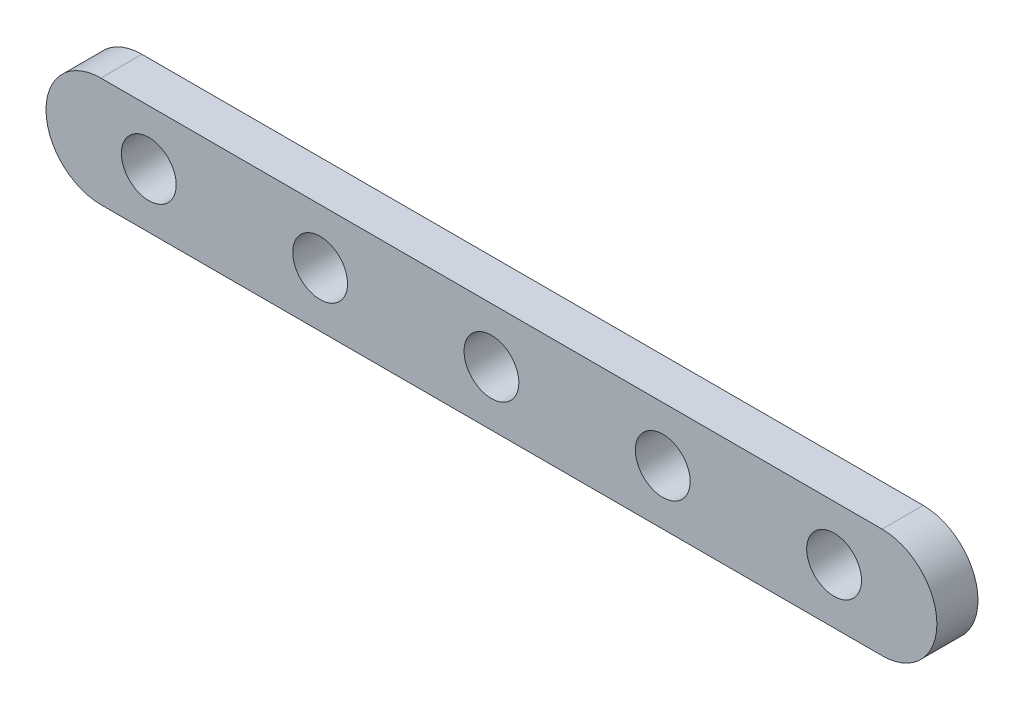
from build123d import *

# Parameters (mm, degrees)
ESQUISSE1_R          = 2
BASE_EXTRUSION_DEPTH = 3


with BuildPart() as part:
    # Esquisse1 → Base-Extrusion (new body)
    with BuildSketch(Plane.XY):
        with BuildLine():
            Line((-28.5, 4), (28.5, 4))
            ThreePointArc((28.5, 4), (32.5, 0), (28.5, -4))
            Line((28.5, -4), (-28.5, -4))
            ThreePointArc((-28.5, -4), (-32.5, 0), (-28.5, 4))
        make_face()
        with Locations((-25, 0)):
            Circle(ESQUISSE1_R, mode=Mode.SUBTRACT)
        with Locations((-12.5, 0)):
            Circle(ESQUISSE1_R, mode=Mode.SUBTRACT)
        Circle(ESQUISSE1_R, mode=Mode.SUBTRACT)
        with Locations((12.5, 0)):
            Circle(ESQUISSE1_R, mode=Mode.SUBTRACT)
        with Locations((25, 0)):
            Circle(ESQUISSE1_R, mode=Mode.SUBTRACT)
    extrude(amount=BASE_EXTRUSION_DEPTH)


solid = part.part
